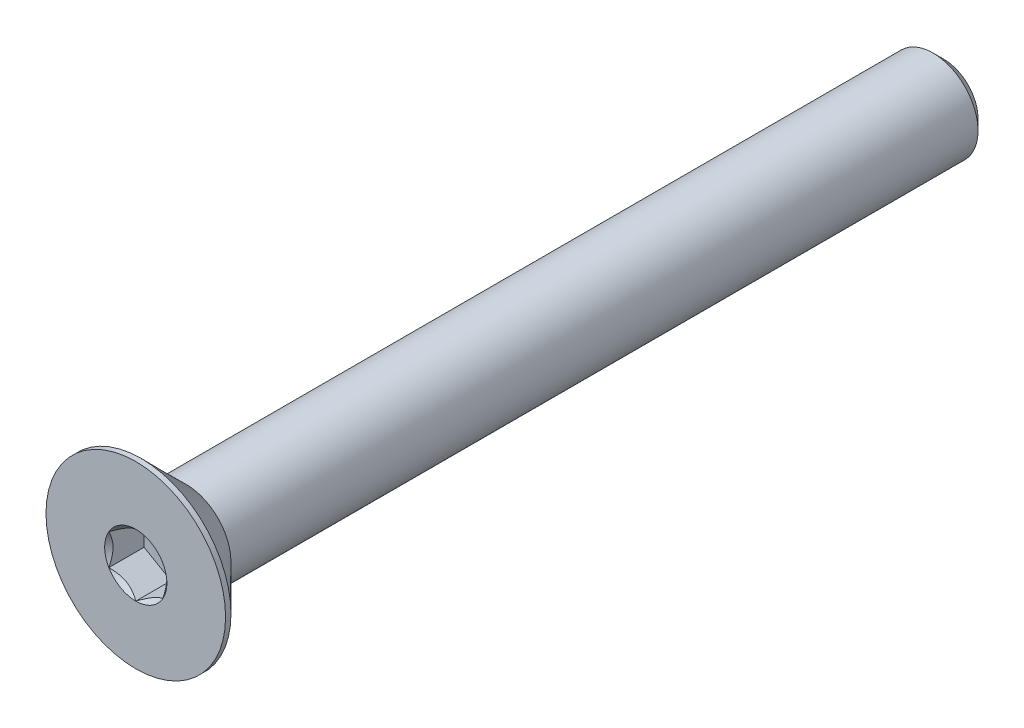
ISO-10303-21;
HEADER;
FILE_DESCRIPTION(('STEP AP214'),'2;1');
FILE_NAME('part.step','',(''),(''),'','','');
FILE_SCHEMA(('AUTOMOTIVE_DESIGN { 1 0 10303 214 1 1 1 1 }'));
ENDSEC;
DATA;
#1=APPLICATION_CONTEXT('core data for automotive mechanical design processes');
#2=APPLICATION_PROTOCOL_DEFINITION('international standard','automotive_design',2000,#1);
#3=PRODUCT_CONTEXT('',#1,'mechanical');
#4=PRODUCT('Part','Part','',(#3));
#5=PRODUCT_RELATED_PRODUCT_CATEGORY('part','',(#4));
#6=PRODUCT_DEFINITION_FORMATION('','',#4);
#7=PRODUCT_DEFINITION_CONTEXT('part definition',#1,'design');
#8=PRODUCT_DEFINITION('design','',#6,#7);
#9=PRODUCT_DEFINITION_SHAPE('','',#8);
#10=(LENGTH_UNIT() NAMED_UNIT(*) SI_UNIT(.MILLI.,.METRE.));
#11=(NAMED_UNIT(*) PLANE_ANGLE_UNIT() SI_UNIT($,.RADIAN.));
#12=(NAMED_UNIT(*) SI_UNIT($,.STERADIAN.) SOLID_ANGLE_UNIT());
#13=UNCERTAINTY_MEASURE_WITH_UNIT(LENGTH_MEASURE(1.E-05),#10,'distance_accuracy_value','');
#14=(GEOMETRIC_REPRESENTATION_CONTEXT(3) GLOBAL_UNCERTAINTY_ASSIGNED_CONTEXT((#13)) GLOBAL_UNIT_ASSIGNED_CONTEXT((#10,
#11,#12)) REPRESENTATION_CONTEXT('',''));
#15=CARTESIAN_POINT('',(0.,0.,0.));
#16=DIRECTION('',(0.,0.,1.));
#17=DIRECTION('',(1.,0.,0.));
#18=AXIS2_PLACEMENT_3D('',#15,#16,#17);
#19=CARTESIAN_POINT('',(0.,0.,-45.));
#20=DIRECTION('',(0.,0.,-1.));
#21=DIRECTION('',(0.,1.,0.));
#22=AXIS2_PLACEMENT_3D('',#19,#20,#21);
#23=CYLINDRICAL_SURFACE('',#22,2.5);
#24=CARTESIAN_POINT('',(0.,0.,-44.4));
#25=DIRECTION('',(0.,0.,-1.));
#26=DIRECTION('',(0.,1.,0.));
#27=AXIS2_PLACEMENT_3D('',#24,#25,#26);
#28=CIRCLE('',#27,2.5);
#29=CARTESIAN_POINT('',(0.,-2.5,-44.4));
#30=VERTEX_POINT('',#29);
#31=EDGE_CURVE('E51',#30,#30,#28,.F.);
#32=ORIENTED_EDGE('',*,*,#31,.T.);
#33=EDGE_LOOP('',(#32));
#34=FACE_BOUND('',#33,.T.);
#35=CARTESIAN_POINT('',(0.,0.,-2.8));
#36=DIRECTION('',(0.,0.,1.));
#37=DIRECTION('',(0.,-1.,0.));
#38=AXIS2_PLACEMENT_3D('',#35,#36,#37);
#39=CIRCLE('',#38,2.50000000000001);
#40=CARTESIAN_POINT('',(0.,-2.50000000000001,-2.79999999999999));
#41=VERTEX_POINT('',#40);
#42=EDGE_CURVE('E169',#41,#41,#39,.T.);
#43=ORIENTED_EDGE('',*,*,#42,.F.);
#44=EDGE_LOOP('',(#43));
#45=FACE_BOUND('',#44,.T.);
#46=ADVANCED_FACE('F37',(#34,#45),#23,.T.);
#47=CARTESIAN_POINT('',(0.,-2.5,-45.));
#48=DIRECTION('',(0.,0.,-1.));
#49=DIRECTION('',(0.,1.,0.));
#50=AXIS2_PLACEMENT_3D('',#47,#48,#49);
#51=PLANE('',#50);
#52=CARTESIAN_POINT('',(0.,0.,-45.));
#53=DIRECTION('',(0.,0.,-1.));
#54=DIRECTION('',(0.,1.,0.));
#55=AXIS2_PLACEMENT_3D('',#52,#53,#54);
#56=CIRCLE('',#55,1.89999999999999);
#57=CARTESIAN_POINT('',(0.,-1.89999999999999,-45.));
#58=VERTEX_POINT('',#57);
#59=EDGE_CURVE('E178',#58,#58,#56,.T.);
#60=ORIENTED_EDGE('',*,*,#59,.T.);
#61=EDGE_LOOP('',(#60));
#62=FACE_BOUND('',#61,.T.);
#63=ADVANCED_FACE('F188',(#62),#51,.T.);
#64=CARTESIAN_POINT('',(0.,0.,-45.));
#65=DIRECTION('',(0.,0.,1.));
#66=DIRECTION('',(0.,-1.,0.));
#67=AXIS2_PLACEMENT_3D('',#64,#65,#66);
#68=CONICAL_SURFACE('',#67,1.89999999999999,0.785398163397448);
#69=CARTESIAN_POINT('',(0.,-2.5,-44.4));
#70=CARTESIAN_POINT('',(0.,-2.49375,-44.40625));
#71=CARTESIAN_POINT('',(0.,-2.4875,-44.4125));
#72=CARTESIAN_POINT('',(0.,-2.475,-44.425));
#73=CARTESIAN_POINT('',(0.,-2.46875,-44.43125));
#74=CARTESIAN_POINT('',(0.,-2.45625,-44.44375));
#75=CARTESIAN_POINT('',(0.,-2.45,-44.45));
#76=CARTESIAN_POINT('',(0.,-2.4375,-44.4625));
#77=CARTESIAN_POINT('',(0.,-2.43125,-44.46875));
#78=CARTESIAN_POINT('',(0.,-2.41874999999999,-44.48125));
#79=CARTESIAN_POINT('',(0.,-2.41249999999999,-44.4875));
#80=CARTESIAN_POINT('',(0.,-2.4,-44.5));
#81=CARTESIAN_POINT('',(0.,-2.39375,-44.50625));
#82=CARTESIAN_POINT('',(0.,-2.38125,-44.51875));
#83=CARTESIAN_POINT('',(0.,-2.375,-44.525));
#84=CARTESIAN_POINT('',(0.,-2.36249999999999,-44.5375));
#85=CARTESIAN_POINT('',(0.,-2.35624999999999,-44.54375));
#86=CARTESIAN_POINT('',(0.,-2.34374999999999,-44.55625));
#87=CARTESIAN_POINT('',(0.,-2.33749999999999,-44.5625));
#88=CARTESIAN_POINT('',(0.,-2.32499999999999,-44.575));
#89=CARTESIAN_POINT('',(0.,-2.31874999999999,-44.58125));
#90=CARTESIAN_POINT('',(0.,-2.30624999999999,-44.59375));
#91=CARTESIAN_POINT('',(0.,-2.29999999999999,-44.6));
#92=CARTESIAN_POINT('',(0.,-2.28749999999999,-44.6125));
#93=CARTESIAN_POINT('',(0.,-2.28124999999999,-44.61875));
#94=CARTESIAN_POINT('',(0.,-2.26874999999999,-44.63125));
#95=CARTESIAN_POINT('',(0.,-2.26249999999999,-44.6375));
#96=CARTESIAN_POINT('',(0.,-2.24999999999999,-44.65));
#97=CARTESIAN_POINT('',(0.,-2.24374999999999,-44.65625));
#98=CARTESIAN_POINT('',(0.,-2.23124999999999,-44.66875));
#99=CARTESIAN_POINT('',(0.,-2.22499999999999,-44.675));
#100=CARTESIAN_POINT('',(0.,-2.21249999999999,-44.6875));
#101=CARTESIAN_POINT('',(0.,-2.20624999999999,-44.69375));
#102=CARTESIAN_POINT('',(0.,-2.19374999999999,-44.70625));
#103=CARTESIAN_POINT('',(0.,-2.18749999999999,-44.7125));
#104=CARTESIAN_POINT('',(0.,-2.17499999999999,-44.725));
#105=CARTESIAN_POINT('',(0.,-2.16874999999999,-44.73125));
#106=CARTESIAN_POINT('',(0.,-2.15624999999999,-44.74375));
#107=CARTESIAN_POINT('',(0.,-2.14999999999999,-44.75));
#108=CARTESIAN_POINT('',(0.,-2.13749999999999,-44.7625));
#109=CARTESIAN_POINT('',(0.,-2.13124999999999,-44.76875));
#110=CARTESIAN_POINT('',(0.,-2.11874999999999,-44.78125));
#111=CARTESIAN_POINT('',(0.,-2.11249999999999,-44.7875));
#112=CARTESIAN_POINT('',(0.,-2.09999999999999,-44.8));
#113=CARTESIAN_POINT('',(0.,-2.09374999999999,-44.80625));
#114=CARTESIAN_POINT('',(0.,-2.08124999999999,-44.81875));
#115=CARTESIAN_POINT('',(0.,-2.07499999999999,-44.825));
#116=CARTESIAN_POINT('',(0.,-2.06249999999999,-44.8375));
#117=CARTESIAN_POINT('',(0.,-2.05624999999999,-44.84375));
#118=CARTESIAN_POINT('',(0.,-2.04374999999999,-44.85625));
#119=CARTESIAN_POINT('',(0.,-2.03749999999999,-44.8625));
#120=CARTESIAN_POINT('',(0.,-2.02499999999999,-44.875));
#121=CARTESIAN_POINT('',(0.,-2.01874999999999,-44.88125));
#122=CARTESIAN_POINT('',(0.,-2.00624999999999,-44.89375));
#123=CARTESIAN_POINT('',(0.,-1.99999999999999,-44.9));
#124=CARTESIAN_POINT('',(0.,-1.98749999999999,-44.9125));
#125=CARTESIAN_POINT('',(0.,-1.98124999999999,-44.91875));
#126=CARTESIAN_POINT('',(0.,-1.96874999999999,-44.93125));
#127=CARTESIAN_POINT('',(0.,-1.96249999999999,-44.9375));
#128=CARTESIAN_POINT('',(0.,-1.94999999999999,-44.95));
#129=CARTESIAN_POINT('',(0.,-1.94374999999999,-44.95625));
#130=CARTESIAN_POINT('',(0.,-1.93124999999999,-44.96875));
#131=CARTESIAN_POINT('',(0.,-1.92499999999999,-44.975));
#132=CARTESIAN_POINT('',(0.,-1.91249999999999,-44.9875));
#133=CARTESIAN_POINT('',(0.,-1.90624999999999,-44.99375));
#134=CARTESIAN_POINT('',(0.,-1.89999999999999,-45.));
#135=B_SPLINE_CURVE_WITH_KNOTS('',3,(#69,#70,#71,#72,#73,#74,#75,#76,#77,#78,#79,#80,#81,#82,
#83,#84,#85,#86,#87,#88,#89,#90,#91,#92,#93,#94,#95,#96,#97,#98,#99,#100,#101,#102,#103,#104,
#105,#106,#107,#108,#109,#110,#111,#112,#113,#114,#115,#116,#117,#118,#119,#120,#121,#122,#123,
#124,#125,#126,#127,#128,#129,#130,#131,#132,#133,#134),.UNSPECIFIED.,.F.,.F.,(4,2,2,2,2,2,2,2,
2,2,2,2,2,2,2,2,2,2,2,2,2,2,2,2,2,2,2,2,2,2,2,2,4),(0.,0.026516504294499,0.0530330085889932,
0.0795495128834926,0.106066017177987,0.132582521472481,0.15909902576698,0.185615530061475,
0.212132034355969,0.238648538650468,0.265165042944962,0.291681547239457,0.318198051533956,
0.34471455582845,0.371231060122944,0.397747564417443,0.424264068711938,0.450780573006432,
0.477297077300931,0.503813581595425,0.53033008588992,0.556846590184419,0.583363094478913,
0.609879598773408,0.636396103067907,0.662912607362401,0.689429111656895,0.715945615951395,
0.742462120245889,0.768978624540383,0.795495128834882,0.822011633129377,0.848528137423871),.UNSPECIFIED.);
#136=EDGE_CURVE('BSEAM39',#30,#58,#135,.T.);
#137=ORIENTED_EDGE('',*,*,#31,.F.);
#138=ORIENTED_EDGE('',*,*,#59,.F.);
#139=ORIENTED_EDGE('',*,*,#136,.T.);
#140=ORIENTED_EDGE('',*,*,#136,.F.);
#141=EDGE_LOOP('',(#137,#139,#138,#140));
#142=FACE_BOUND('',#141,.T.);
#143=ADVANCED_FACE('F39',(#142),#68,.T.);
#144=CARTESIAN_POINT('',(0.,0.,0.));
#145=DIRECTION('',(0.,0.,1.));
#146=DIRECTION('',(0.,-1.,0.));
#147=AXIS2_PLACEMENT_3D('',#144,#145,#146);
#148=CYLINDRICAL_SURFACE('',#147,5.);
#149=CARTESIAN_POINT('',(0.,0.,0.));
#150=DIRECTION('',(0.,0.,1.));
#151=DIRECTION('',(0.,-1.,0.));
#152=AXIS2_PLACEMENT_3D('',#149,#150,#151);
#153=CIRCLE('',#152,5.);
#154=CARTESIAN_POINT('',(0.,-5.,0.));
#155=VERTEX_POINT('',#154);
#156=EDGE_CURVE('E175',#155,#155,#153,.T.);
#157=ORIENTED_EDGE('',*,*,#156,.F.);
#158=EDGE_LOOP('',(#157));
#159=FACE_BOUND('',#158,.T.);
#160=CARTESIAN_POINT('',(0.,0.,-0.300000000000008));
#161=DIRECTION('',(0.,0.,1.));
#162=DIRECTION('',(0.,-1.,0.));
#163=AXIS2_PLACEMENT_3D('',#160,#161,#162);
#164=CIRCLE('',#163,5.);
#165=CARTESIAN_POINT('',(0.,-5.,-0.300000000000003));
#166=VERTEX_POINT('',#165);
#167=EDGE_CURVE('E172',#166,#166,#164,.T.);
#168=ORIENTED_EDGE('',*,*,#167,.T.);
#169=EDGE_LOOP('',(#168));
#170=FACE_BOUND('',#169,.T.);
#171=ADVANCED_FACE('F187',(#159,#170),#148,.T.);
#172=CARTESIAN_POINT('',(0.,0.,-2.8));
#173=DIRECTION('',(0.,0.,1.));
#174=DIRECTION('',(0.,-1.,0.));
#175=AXIS2_PLACEMENT_3D('',#172,#173,#174);
#176=CONICAL_SURFACE('',#175,2.50000000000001,0.78539816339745);
#177=ORIENTED_EDGE('',*,*,#167,.F.);
#178=EDGE_LOOP('',(#177));
#179=FACE_BOUND('',#178,.T.);
#180=ORIENTED_EDGE('',*,*,#42,.T.);
#181=EDGE_LOOP('',(#180));
#182=FACE_BOUND('',#181,.T.);
#183=ADVANCED_FACE('F199',(#179,#182),#176,.T.);
#184=CARTESIAN_POINT('',(0.,-2.5,0.));
#185=DIRECTION('',(0.,0.,1.));
#186=DIRECTION('',(0.,-1.,0.));
#187=AXIS2_PLACEMENT_3D('',#184,#185,#186);
#188=PLANE('',#187);
#189=CARTESIAN_POINT('',(0.,0.,0.));
#190=DIRECTION('',(0.,0.,1.));
#191=DIRECTION('',(1.,0.,0.));
#192=AXIS2_PLACEMENT_3D('',#189,#190,#191);
#193=CIRCLE('',#192,1.73205080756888);
#194=CARTESIAN_POINT('',(0.,-1.73205080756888,0.));
#195=VERTEX_POINT('',#194);
#196=CARTESIAN_POINT('',(1.5,-0.86602540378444,0.));
#197=VERTEX_POINT('',#196);
#198=EDGE_CURVE('E97',#195,#197,#193,.T.);
#199=ORIENTED_EDGE('',*,*,#198,.F.);
#200=CARTESIAN_POINT('',(-1.5,-0.866025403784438,0.));
#201=VERTEX_POINT('',#200);
#202=EDGE_CURVE('E57',#201,#195,#193,.T.);
#203=ORIENTED_EDGE('',*,*,#202,.F.);
#204=CARTESIAN_POINT('',(-1.5,0.86602540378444,0.));
#205=VERTEX_POINT('',#204);
#206=EDGE_CURVE('E139',#205,#201,#193,.T.);
#207=ORIENTED_EDGE('',*,*,#206,.F.);
#208=CARTESIAN_POINT('',(0.,1.73205080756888,0.));
#209=VERTEX_POINT('',#208);
#210=EDGE_CURVE('E64',#209,#205,#193,.T.);
#211=ORIENTED_EDGE('',*,*,#210,.F.);
#212=CARTESIAN_POINT('',(1.5,0.866025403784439,0.));
#213=VERTEX_POINT('',#212);
#214=EDGE_CURVE('E133',#213,#209,#193,.T.);
#215=ORIENTED_EDGE('',*,*,#214,.F.);
#216=EDGE_CURVE('E105',#197,#213,#193,.T.);
#217=ORIENTED_EDGE('',*,*,#216,.F.);
#218=EDGE_LOOP('',(#199,#203,#207,#211,#215,#217));
#219=FACE_BOUND('',#218,.T.);
#220=ORIENTED_EDGE('',*,*,#156,.T.);
#221=EDGE_LOOP('',(#220));
#222=FACE_BOUND('',#221,.T.);
#223=ADVANCED_FACE('F131',(#219,#222),#188,.T.);
#224=CARTESIAN_POINT('',(0.,0.,0.));
#225=DIRECTION('',(0.,0.,1.));
#226=DIRECTION('',(1.,0.,0.));
#227=AXIS2_PLACEMENT_3D('',#224,#225,#226);
#228=CONICAL_SURFACE('',#227,1.73205080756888,0.78539816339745);
#229=ORIENTED_EDGE('',*,*,#216,.T.);
#230=CARTESIAN_POINT('',(1.5,-1.72720812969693,0.555578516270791));
#231=CARTESIAN_POINT('',(1.5,-1.68515175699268,0.523829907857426));
#232=CARTESIAN_POINT('',(1.5,-1.64286104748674,0.492392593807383));
#233=CARTESIAN_POINT('',(1.5,-1.55771581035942,0.430269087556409));
#234=CARTESIAN_POINT('',(1.5,-1.51486114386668,0.399583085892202));
#235=CARTESIAN_POINT('',(1.5,-1.3846813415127,0.308407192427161));
#236=CARTESIAN_POINT('',(1.5,-1.29637976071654,0.249288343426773));
#237=CARTESIAN_POINT('',(1.5,-1.11121478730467,0.133230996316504));
#238=CARTESIAN_POINT('',(1.5,-1.01415038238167,0.0766095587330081));
#239=CARTESIAN_POINT('',(1.5,-0.815173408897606,-0.0269631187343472));
#240=CARTESIAN_POINT('',(1.5,-0.713278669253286,-0.0739469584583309));
#241=CARTESIAN_POINT('',(1.5,-0.560333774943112,-0.131427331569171));
#242=CARTESIAN_POINT('',(1.5,-0.511547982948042,-0.147924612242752));
#243=CARTESIAN_POINT('',(1.5,-0.412798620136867,-0.177002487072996));
#244=CARTESIAN_POINT('',(1.5,-0.362834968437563,-0.189582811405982));
#245=CARTESIAN_POINT('',(1.5,-0.262863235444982,-0.209963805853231));
#246=CARTESIAN_POINT('',(1.5,-0.212872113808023,-0.21784636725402));
#247=CARTESIAN_POINT('',(1.5,-0.112355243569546,-0.228677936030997));
#248=CARTESIAN_POINT('',(1.5,-0.0618295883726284,-0.23162779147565));
#249=CARTESIAN_POINT('',(1.5,0.0374291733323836,-0.232375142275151));
#250=CARTESIAN_POINT('',(1.5,0.0861609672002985,-0.230355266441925));
#251=CARTESIAN_POINT('',(1.5,0.183206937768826,-0.221677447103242));
#252=CARTESIAN_POINT('',(1.5,0.231521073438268,-0.215019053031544));
#253=CARTESIAN_POINT('',(1.5,0.328199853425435,-0.197314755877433));
#254=CARTESIAN_POINT('',(1.5,0.376550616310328,-0.186194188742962));
#255=CARTESIAN_POINT('',(1.5,0.472195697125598,-0.160156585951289));
#256=CARTESIAN_POINT('',(1.5,0.51949010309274,-0.145239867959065));
#257=CARTESIAN_POINT('',(1.5,0.668391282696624,-0.0926647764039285));
#258=CARTESIAN_POINT('',(1.5,0.767878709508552,-0.0490187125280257));
#259=CARTESIAN_POINT('',(1.5,0.962179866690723,0.048022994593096));
#260=CARTESIAN_POINT('',(1.5,1.05697519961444,0.101453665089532));
#261=CARTESIAN_POINT('',(1.5,1.23814273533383,0.211685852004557));
#262=CARTESIAN_POINT('',(1.5,1.32469942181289,0.268187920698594));
#263=CARTESIAN_POINT('',(1.5,1.45222331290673,0.355534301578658));
#264=CARTESIAN_POINT('',(1.5,1.49418091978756,0.384957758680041));
#265=CARTESIAN_POINT('',(1.5,1.57752272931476,0.444582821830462));
#266=CARTESIAN_POINT('',(1.5,1.61890708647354,0.474784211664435));
#267=CARTESIAN_POINT('',(1.5,1.66005278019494,0.505308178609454));
#268=B_SPLINE_CURVE_WITH_KNOTS('',3,(#230,#231,#232,#233,#234,#235,#236,#237,#238,#239,#240,
#241,#242,#243,#244,#245,#246,#247,#248,#249,#250,#251,#252,#253,#254,#255,#256,#257,#258,#259,
#260,#261,#262,#263,#264,#265,#266,#267),.UNSPECIFIED.,.F.,.F.,(4,2,2,2,2,2,2,2,2,2,2,2,2,2,2,2,
2,2,4),(0.,0.158079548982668,0.316198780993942,0.634850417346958,0.97169031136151,
1.30737131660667,1.46173961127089,1.61611853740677,1.7677210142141,1.91929742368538,
2.065387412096,2.21149159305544,2.36014984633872,2.50879566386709,2.83376031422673,
3.15991186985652,3.46985601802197,3.62358896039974,3.7772796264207),.UNSPECIFIED.);
#269=EDGE_CURVE('E11',#197,#213,#268,.T.);
#270=ORIENTED_EDGE('',*,*,#269,.F.);
#271=EDGE_LOOP('',(#229,#270));
#272=FACE_BOUND('',#271,.T.);
#273=ADVANCED_FACE('F109',(#272),#228,.F.);
#274=ORIENTED_EDGE('',*,*,#214,.T.);
#275=CARTESIAN_POINT('',(1.5002,0.865909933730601,0.000115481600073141));
#276=CARTESIAN_POINT('',(1.44863220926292,0.895682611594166,-0.0296345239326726));
#277=CARTESIAN_POINT('',(1.3962020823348,0.925953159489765,-0.0576375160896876));
#278=CARTESIAN_POINT('',(1.2892909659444,0.987678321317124,-0.108910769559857));
#279=CARTESIAN_POINT('',(1.23479980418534,1.01913880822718,-0.132152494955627));
#280=CARTESIAN_POINT('',(1.12492091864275,1.08257741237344,-0.17196627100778));
#281=CARTESIAN_POINT('',(1.0695611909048,1.11453936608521,-0.188638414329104));
#282=CARTESIAN_POINT('',(0.957622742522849,1.1791670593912,-0.214325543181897));
#283=CARTESIAN_POINT('',(0.901047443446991,1.21183082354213,-0.223359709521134));
#284=CARTESIAN_POINT('',(0.803544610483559,1.26812411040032,-0.231510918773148));
#285=CARTESIAN_POINT('',(0.762743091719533,1.29168087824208,-0.232717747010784));
#286=CARTESIAN_POINT('',(0.681212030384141,1.33875285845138,-0.230685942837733));
#287=CARTESIAN_POINT('',(0.640482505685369,1.36226806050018,-0.227446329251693));
#288=CARTESIAN_POINT('',(0.559415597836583,1.40907206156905,-0.216708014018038));
#289=CARTESIAN_POINT('',(0.519078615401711,1.43236062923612,-0.209205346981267));
#290=CARTESIAN_POINT('',(0.439081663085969,1.47854689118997,-0.19034838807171));
#291=CARTESIAN_POINT('',(0.399421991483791,1.50144441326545,-0.178992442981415));
#292=CARTESIAN_POINT('',(0.297836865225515,1.56009461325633,-0.145278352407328));
#293=CARTESIAN_POINT('',(0.236541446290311,1.59548353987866,-0.120378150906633));
#294=CARTESIAN_POINT('',(0.146414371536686,1.64751843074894,-0.0783433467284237));
#295=CARTESIAN_POINT('',(0.116714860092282,1.66466545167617,-0.0635748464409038));
#296=CARTESIAN_POINT('',(0.0578620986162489,1.69864410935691,-0.0326894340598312));
#297=CARTESIAN_POINT('',(0.0287085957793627,1.71547589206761,-0.0165731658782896));
#298=CARTESIAN_POINT('',(-0.00020000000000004,1.73216627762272,0.000115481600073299));
#299=B_SPLINE_CURVE_WITH_KNOTS('',3,(#275,#276,#277,#278,#279,#280,#281,#282,#283,#284,#285,
#286,#287,#288,#289,#290,#291,#292,#293,#294,#295,#296,#297,#298),.UNSPECIFIED.,.F.,.F.,(4,2,2,
2,2,2,2,2,2,2,2,4),(0.,0.199829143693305,0.400822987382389,0.598623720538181,0.79592624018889,
0.937113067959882,1.07833105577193,1.21968061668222,1.36109089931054,1.58570969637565,
1.69770705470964,1.80965120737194),.UNSPECIFIED.);
#300=EDGE_CURVE('E135',#213,#209,#299,.T.);
#301=ORIENTED_EDGE('',*,*,#300,.F.);
#302=EDGE_LOOP('',(#274,#301));
#303=FACE_BOUND('',#302,.T.);
#304=ADVANCED_FACE('F279',(#303),#228,.F.);
#305=ORIENTED_EDGE('',*,*,#210,.T.);
#306=CARTESIAN_POINT('',(0.000199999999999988,1.73216627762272,0.000115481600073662));
#307=CARTESIAN_POINT('',(-0.0513677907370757,1.70239359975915,-0.029634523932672));
#308=CARTESIAN_POINT('',(-0.103797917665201,1.67212305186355,-0.0576375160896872));
#309=CARTESIAN_POINT('',(-0.210709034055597,1.61039789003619,-0.108910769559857));
#310=CARTESIAN_POINT('',(-0.265200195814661,1.57893740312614,-0.132152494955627));
#311=CARTESIAN_POINT('',(-0.375079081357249,1.51549879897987,-0.17196627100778));
#312=CARTESIAN_POINT('',(-0.4304388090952,1.4835368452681,-0.188638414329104));
#313=CARTESIAN_POINT('',(-0.542377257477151,1.41890915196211,-0.214325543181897));
#314=CARTESIAN_POINT('',(-0.598952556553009,1.38624538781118,-0.223359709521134));
#315=CARTESIAN_POINT('',(-0.696455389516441,1.329952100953,-0.231510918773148));
#316=CARTESIAN_POINT('',(-0.737256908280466,1.30639533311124,-0.232717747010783));
#317=CARTESIAN_POINT('',(-0.818787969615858,1.25932335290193,-0.230685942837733));
#318=CARTESIAN_POINT('',(-0.85951749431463,1.23580815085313,-0.227446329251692));
#319=CARTESIAN_POINT('',(-0.940584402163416,1.18900414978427,-0.216708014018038));
#320=CARTESIAN_POINT('',(-0.980921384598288,1.1657155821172,-0.209205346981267));
#321=CARTESIAN_POINT('',(-1.06091833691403,1.11952932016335,-0.19034838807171));
#322=CARTESIAN_POINT('',(-1.10057800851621,1.09663179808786,-0.178992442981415));
#323=CARTESIAN_POINT('',(-1.20216313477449,1.03798159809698,-0.145278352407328));
#324=CARTESIAN_POINT('',(-1.26345855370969,1.00259267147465,-0.120378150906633));
#325=CARTESIAN_POINT('',(-1.35358562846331,0.950557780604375,-0.078343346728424));
#326=CARTESIAN_POINT('',(-1.38328513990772,0.933410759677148,-0.0635748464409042));
#327=CARTESIAN_POINT('',(-1.44213790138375,0.899432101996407,-0.0326894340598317));
#328=CARTESIAN_POINT('',(-1.47129140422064,0.882600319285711,-0.01657316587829));
#329=CARTESIAN_POINT('',(-1.5002,0.865909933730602,0.000115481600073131));
#330=B_SPLINE_CURVE_WITH_KNOTS('',3,(#306,#307,#308,#309,#310,#311,#312,#313,#314,#315,#316,
#317,#318,#319,#320,#321,#322,#323,#324,#325,#326,#327,#328,#329),.UNSPECIFIED.,.F.,.F.,(4,2,2,
2,2,2,2,2,2,2,2,4),(0.,0.199829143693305,0.400822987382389,0.598623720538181,0.795926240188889,
0.937113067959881,1.07833105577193,1.21968061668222,1.36109089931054,1.58570969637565,
1.69770705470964,1.80965120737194),.UNSPECIFIED.);
#331=EDGE_CURVE('E138',#209,#205,#330,.T.);
#332=ORIENTED_EDGE('',*,*,#331,.F.);
#333=EDGE_LOOP('',(#305,#332));
#334=FACE_BOUND('',#333,.T.);
#335=ADVANCED_FACE('F275',(#334),#228,.F.);
#336=ORIENTED_EDGE('',*,*,#206,.T.);
#337=CARTESIAN_POINT('',(-1.5,-1.72720812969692,0.555578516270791));
#338=CARTESIAN_POINT('',(-1.5,-1.68515175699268,0.523829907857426));
#339=CARTESIAN_POINT('',(-1.5,-1.64286104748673,0.492392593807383));
#340=CARTESIAN_POINT('',(-1.5,-1.55771581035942,0.430269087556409));
#341=CARTESIAN_POINT('',(-1.5,-1.51486114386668,0.399583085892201));
#342=CARTESIAN_POINT('',(-1.5,-1.3846813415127,0.30840719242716));
#343=CARTESIAN_POINT('',(-1.5,-1.29637976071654,0.249288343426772));
#344=CARTESIAN_POINT('',(-1.5,-1.11121478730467,0.133230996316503));
#345=CARTESIAN_POINT('',(-1.5,-1.01415038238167,0.0766095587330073));
#346=CARTESIAN_POINT('',(-1.5,-0.815173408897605,-0.0269631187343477));
#347=CARTESIAN_POINT('',(-1.5,-0.713278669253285,-0.073946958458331));
#348=CARTESIAN_POINT('',(-1.5,-0.560333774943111,-0.131427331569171));
#349=CARTESIAN_POINT('',(-1.5,-0.511547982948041,-0.147924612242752));
#350=CARTESIAN_POINT('',(-1.5,-0.412798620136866,-0.177002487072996));
#351=CARTESIAN_POINT('',(-1.5,-0.362834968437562,-0.189582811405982));
#352=CARTESIAN_POINT('',(-1.5,-0.262863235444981,-0.209963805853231));
#353=CARTESIAN_POINT('',(-1.5,-0.212872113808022,-0.21784636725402));
#354=CARTESIAN_POINT('',(-1.5,-0.112355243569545,-0.228677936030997));
#355=CARTESIAN_POINT('',(-1.5,-0.0618295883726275,-0.23162779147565));
#356=CARTESIAN_POINT('',(-1.5,0.0374291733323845,-0.232375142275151));
#357=CARTESIAN_POINT('',(-1.5,0.0861609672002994,-0.230355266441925));
#358=CARTESIAN_POINT('',(-1.5,0.183206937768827,-0.221677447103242));
#359=CARTESIAN_POINT('',(-1.5,0.231521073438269,-0.215019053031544));
#360=CARTESIAN_POINT('',(-1.5,0.328199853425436,-0.197314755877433));
#361=CARTESIAN_POINT('',(-1.5,0.376550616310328,-0.186194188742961));
#362=CARTESIAN_POINT('',(-1.5,0.472195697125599,-0.160156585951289));
#363=CARTESIAN_POINT('',(-1.5,0.519490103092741,-0.145239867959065));
#364=CARTESIAN_POINT('',(-1.5,0.668391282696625,-0.0926647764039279));
#365=CARTESIAN_POINT('',(-1.5,0.767878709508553,-0.0490187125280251));
#366=CARTESIAN_POINT('',(-1.5,0.962179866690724,0.0480229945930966));
#367=CARTESIAN_POINT('',(-1.5,1.05697519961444,0.101453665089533));
#368=CARTESIAN_POINT('',(-1.5,1.23814273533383,0.211685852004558));
#369=CARTESIAN_POINT('',(-1.5,1.3246994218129,0.268187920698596));
#370=CARTESIAN_POINT('',(-1.5,1.45222331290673,0.355534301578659));
#371=CARTESIAN_POINT('',(-1.5,1.49418091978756,0.384957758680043));
#372=CARTESIAN_POINT('',(-1.5,1.57752272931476,0.444582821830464));
#373=CARTESIAN_POINT('',(-1.5,1.61890708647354,0.474784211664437));
#374=CARTESIAN_POINT('',(-1.5,1.66005278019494,0.505308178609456));
#375=B_SPLINE_CURVE_WITH_KNOTS('',3,(#337,#338,#339,#340,#341,#342,#343,#344,#345,#346,#347,
#348,#349,#350,#351,#352,#353,#354,#355,#356,#357,#358,#359,#360,#361,#362,#363,#364,#365,#366,
#367,#368,#369,#370,#371,#372,#373,#374),.UNSPECIFIED.,.F.,.F.,(4,2,2,2,2,2,2,2,2,2,2,2,2,2,2,2,
2,2,4),(0.,0.158079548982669,0.316198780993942,0.634850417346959,0.97169031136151,
1.30737131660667,1.46173961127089,1.61611853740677,1.7677210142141,1.91929742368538,
2.065387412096,2.21149159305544,2.36014984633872,2.50879566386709,2.83376031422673,
3.15991186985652,3.46985601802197,3.62358896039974,3.77727962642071),.UNSPECIFIED.);
#376=EDGE_CURVE('E145',#205,#201,#375,.F.);
#377=ORIENTED_EDGE('',*,*,#376,.F.);
#378=EDGE_LOOP('',(#336,#377));
#379=FACE_BOUND('',#378,.T.);
#380=ADVANCED_FACE('F143',(#379),#228,.F.);
#381=ORIENTED_EDGE('',*,*,#202,.T.);
#382=CARTESIAN_POINT('',(-1.5002,-0.8659099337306,0.000115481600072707));
#383=CARTESIAN_POINT('',(-1.44863220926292,-0.895682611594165,-0.0296345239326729));
#384=CARTESIAN_POINT('',(-1.3962020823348,-0.925953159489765,-0.0576375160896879));
#385=CARTESIAN_POINT('',(-1.2892909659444,-0.987678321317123,-0.108910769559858));
#386=CARTESIAN_POINT('',(-1.23479980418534,-1.01913880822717,-0.132152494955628));
#387=CARTESIAN_POINT('',(-1.12492091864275,-1.08257741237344,-0.171966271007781));
#388=CARTESIAN_POINT('',(-1.0695611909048,-1.11453936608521,-0.188638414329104));
#389=CARTESIAN_POINT('',(-0.95762274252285,-1.1791670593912,-0.214325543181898));
#390=CARTESIAN_POINT('',(-0.901047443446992,-1.21183082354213,-0.223359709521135));
#391=CARTESIAN_POINT('',(-0.803544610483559,-1.26812411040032,-0.231510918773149));
#392=CARTESIAN_POINT('',(-0.762743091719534,-1.29168087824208,-0.232717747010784));
#393=CARTESIAN_POINT('',(-0.681212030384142,-1.33875285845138,-0.230685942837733));
#394=CARTESIAN_POINT('',(-0.64048250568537,-1.36226806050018,-0.227446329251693));
#395=CARTESIAN_POINT('',(-0.559415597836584,-1.40907206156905,-0.216708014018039));
#396=CARTESIAN_POINT('',(-0.519078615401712,-1.43236062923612,-0.209205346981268));
#397=CARTESIAN_POINT('',(-0.439081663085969,-1.47854689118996,-0.19034838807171));
#398=CARTESIAN_POINT('',(-0.399421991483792,-1.50144441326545,-0.178992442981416));
#399=CARTESIAN_POINT('',(-0.297836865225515,-1.56009461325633,-0.145278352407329));
#400=CARTESIAN_POINT('',(-0.236541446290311,-1.59548353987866,-0.120378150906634));
#401=CARTESIAN_POINT('',(-0.146414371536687,-1.64751843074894,-0.0783433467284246));
#402=CARTESIAN_POINT('',(-0.116714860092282,-1.66466545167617,-0.0635748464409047));
#403=CARTESIAN_POINT('',(-0.0578620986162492,-1.69864410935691,-0.032689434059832));
#404=CARTESIAN_POINT('',(-0.0287085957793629,-1.71547589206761,-0.0165731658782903));
#405=CARTESIAN_POINT('',(0.000199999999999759,-1.73216627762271,0.000115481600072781));
#406=B_SPLINE_CURVE_WITH_KNOTS('',3,(#382,#383,#384,#385,#386,#387,#388,#389,#390,#391,#392,
#393,#394,#395,#396,#397,#398,#399,#400,#401,#402,#403,#404,#405),.UNSPECIFIED.,.F.,.F.,(4,2,2,
2,2,2,2,2,2,2,2,4),(0.,0.199829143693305,0.400822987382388,0.59862372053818,0.795926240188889,
0.937113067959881,1.07833105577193,1.21968061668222,1.36109089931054,1.58570969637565,
1.69770705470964,1.80965120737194),.UNSPECIFIED.);
#407=EDGE_CURVE('E121',#201,#195,#406,.T.);
#408=ORIENTED_EDGE('',*,*,#407,.F.);
#409=EDGE_LOOP('',(#381,#408));
#410=FACE_BOUND('',#409,.T.);
#411=ADVANCED_FACE('F227',(#410),#228,.F.);
#412=ORIENTED_EDGE('',*,*,#198,.T.);
#413=CARTESIAN_POINT('',(-0.000200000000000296,-1.73216627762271,0.000115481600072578));
#414=CARTESIAN_POINT('',(0.0513677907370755,-1.70239359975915,-0.0296345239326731));
#415=CARTESIAN_POINT('',(0.103797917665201,-1.67212305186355,-0.0576375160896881));
#416=CARTESIAN_POINT('',(0.210709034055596,-1.61039789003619,-0.108910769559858));
#417=CARTESIAN_POINT('',(0.265200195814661,-1.57893740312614,-0.132152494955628));
#418=CARTESIAN_POINT('',(0.375079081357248,-1.51549879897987,-0.171966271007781));
#419=CARTESIAN_POINT('',(0.430438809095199,-1.4835368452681,-0.188638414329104));
#420=CARTESIAN_POINT('',(0.54237725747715,-1.41890915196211,-0.214325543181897));
#421=CARTESIAN_POINT('',(0.598952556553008,-1.38624538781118,-0.223359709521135));
#422=CARTESIAN_POINT('',(0.69645538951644,-1.32995210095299,-0.231510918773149));
#423=CARTESIAN_POINT('',(0.737256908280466,-1.30639533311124,-0.232717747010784));
#424=CARTESIAN_POINT('',(0.818787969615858,-1.25932335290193,-0.230685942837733));
#425=CARTESIAN_POINT('',(0.859517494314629,-1.23580815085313,-0.227446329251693));
#426=CARTESIAN_POINT('',(0.940584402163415,-1.18900414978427,-0.216708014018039));
#427=CARTESIAN_POINT('',(0.980921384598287,-1.1657155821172,-0.209205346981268));
#428=CARTESIAN_POINT('',(1.06091833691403,-1.11952932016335,-0.19034838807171));
#429=CARTESIAN_POINT('',(1.10057800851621,-1.09663179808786,-0.178992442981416));
#430=CARTESIAN_POINT('',(1.20216313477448,-1.03798159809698,-0.145278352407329));
#431=CARTESIAN_POINT('',(1.26345855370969,-1.00259267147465,-0.120378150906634));
#432=CARTESIAN_POINT('',(1.35358562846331,-0.950557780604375,-0.0783433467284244));
#433=CARTESIAN_POINT('',(1.38328513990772,-0.933410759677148,-0.0635748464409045));
#434=CARTESIAN_POINT('',(1.44213790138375,-0.899432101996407,-0.0326894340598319));
#435=CARTESIAN_POINT('',(1.47129140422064,-0.88260031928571,-0.0165731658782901));
#436=CARTESIAN_POINT('',(1.5002,-0.865909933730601,0.000115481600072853));
#437=B_SPLINE_CURVE_WITH_KNOTS('',3,(#413,#414,#415,#416,#417,#418,#419,#420,#421,#422,#423,
#424,#425,#426,#427,#428,#429,#430,#431,#432,#433,#434,#435,#436),.UNSPECIFIED.,.F.,.F.,(4,2,2,
2,2,2,2,2,2,2,2,4),(0.,0.199829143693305,0.400822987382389,0.59862372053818,0.795926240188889,
0.937113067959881,1.07833105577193,1.21968061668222,1.36109089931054,1.58570969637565,
1.69770705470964,1.80965120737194),.UNSPECIFIED.);
#438=EDGE_CURVE('E101',#195,#197,#437,.T.);
#439=ORIENTED_EDGE('',*,*,#438,.F.);
#440=EDGE_LOOP('',(#412,#439));
#441=FACE_BOUND('',#440,.T.);
#442=ADVANCED_FACE('F99',(#441),#228,.F.);
#443=CARTESIAN_POINT('',(1.5,-0.866025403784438,-1.96));
#444=DIRECTION('',(0.,0.,1.));
#445=DIRECTION('',(1.,0.,0.));
#446=AXIS2_PLACEMENT_3D('',#443,#444,#445);
#447=PLANE('',#446);
#448=DIRECTION('',(0.866025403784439,0.5,0.));
#449=VECTOR('',#448,1.);
#450=CARTESIAN_POINT('',(0.,-1.73205080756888,-1.96));
#451=LINE('',#450,#449);
#452=CARTESIAN_POINT('',(0.,-1.73205080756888,-1.96));
#453=VERTEX_POINT('',#452);
#454=CARTESIAN_POINT('',(1.5,-0.866025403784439,-1.96));
#455=VERTEX_POINT('',#454);
#456=EDGE_CURVE('E120',#453,#455,#451,.T.);
#457=ORIENTED_EDGE('',*,*,#456,.T.);
#458=DIRECTION('',(0.,1.,0.));
#459=VECTOR('',#458,1.);
#460=CARTESIAN_POINT('',(1.5,-0.866025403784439,-1.96));
#461=LINE('',#460,#459);
#462=CARTESIAN_POINT('',(1.5,0.866025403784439,-1.96));
#463=VERTEX_POINT('',#462);
#464=EDGE_CURVE('E125',#455,#463,#461,.T.);
#465=ORIENTED_EDGE('',*,*,#464,.T.);
#466=DIRECTION('',(-0.866025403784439,0.5,0.));
#467=VECTOR('',#466,1.);
#468=CARTESIAN_POINT('',(1.5,0.866025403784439,-1.96));
#469=LINE('',#468,#467);
#470=CARTESIAN_POINT('',(0.,1.73205080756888,-1.96));
#471=VERTEX_POINT('',#470);
#472=EDGE_CURVE('E261',#463,#471,#469,.T.);
#473=ORIENTED_EDGE('',*,*,#472,.T.);
#474=DIRECTION('',(-0.866025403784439,-0.5,0.));
#475=VECTOR('',#474,1.);
#476=CARTESIAN_POINT('',(0.,1.73205080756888,-1.96));
#477=LINE('',#476,#475);
#478=CARTESIAN_POINT('',(-1.5,0.866025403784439,-1.96));
#479=VERTEX_POINT('',#478);
#480=EDGE_CURVE('E263',#471,#479,#477,.T.);
#481=ORIENTED_EDGE('',*,*,#480,.T.);
#482=DIRECTION('',(0.,-1.,0.));
#483=VECTOR('',#482,1.);
#484=CARTESIAN_POINT('',(-1.5,0.866025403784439,-1.96));
#485=LINE('',#484,#483);
#486=CARTESIAN_POINT('',(-1.5,-0.866025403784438,-1.96));
#487=VERTEX_POINT('',#486);
#488=EDGE_CURVE('E160',#479,#487,#485,.T.);
#489=ORIENTED_EDGE('',*,*,#488,.T.);
#490=DIRECTION('',(0.866025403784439,-0.5,0.));
#491=VECTOR('',#490,1.);
#492=CARTESIAN_POINT('',(-1.5,-0.866025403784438,-1.96));
#493=LINE('',#492,#491);
#494=EDGE_CURVE('E128',#487,#453,#493,.T.);
#495=ORIENTED_EDGE('',*,*,#494,.T.);
#496=EDGE_LOOP('',(#457,#465,#473,#481,#489,#495));
#497=FACE_BOUND('',#496,.T.);
#498=ADVANCED_FACE('F226',(#497),#447,.T.);
#499=CARTESIAN_POINT('',(1.5,-0.866025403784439,-1.96));
#500=DIRECTION('',(1.,0.,0.));
#501=DIRECTION('',(0.,1.,0.));
#502=AXIS2_PLACEMENT_3D('',#499,#500,#501);
#503=PLANE('',#502);
#504=DIRECTION('',(0.,0.,1.));
#505=VECTOR('',#504,1.);
#506=CARTESIAN_POINT('',(1.5,-0.866025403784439,-1.96));
#507=LINE('',#506,#505);
#508=EDGE_CURVE('E117',#455,#197,#507,.T.);
#509=ORIENTED_EDGE('',*,*,#508,.T.);
#510=ORIENTED_EDGE('',*,*,#269,.T.);
#511=DIRECTION('',(0.,0.,1.));
#512=VECTOR('',#511,1.);
#513=CARTESIAN_POINT('',(1.5,0.866025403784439,-1.96));
#514=LINE('',#513,#512);
#515=EDGE_CURVE('E127',#463,#213,#514,.T.);
#516=ORIENTED_EDGE('',*,*,#515,.F.);
#517=ORIENTED_EDGE('',*,*,#464,.F.);
#518=EDGE_LOOP('',(#509,#510,#516,#517));
#519=FACE_BOUND('',#518,.T.);
#520=ADVANCED_FACE('F123',(#519),#503,.F.);
#521=CARTESIAN_POINT('',(1.5,0.866025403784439,-1.96));
#522=DIRECTION('',(0.5,0.866025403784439,0.));
#523=DIRECTION('',(-0.866025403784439,0.5,0.));
#524=AXIS2_PLACEMENT_3D('',#521,#522,#523);
#525=PLANE('',#524);
#526=ORIENTED_EDGE('',*,*,#515,.T.);
#527=ORIENTED_EDGE('',*,*,#300,.T.);
#528=DIRECTION('',(0.,0.,1.));
#529=VECTOR('',#528,1.);
#530=CARTESIAN_POINT('',(0.,1.73205080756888,-1.96));
#531=LINE('',#530,#529);
#532=EDGE_CURVE('E156',#471,#209,#531,.T.);
#533=ORIENTED_EDGE('',*,*,#532,.F.);
#534=ORIENTED_EDGE('',*,*,#472,.F.);
#535=EDGE_LOOP('',(#526,#527,#533,#534));
#536=FACE_BOUND('',#535,.T.);
#537=ADVANCED_FACE('F252',(#536),#525,.F.);
#538=CARTESIAN_POINT('',(0.,1.73205080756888,-1.96));
#539=DIRECTION('',(-0.5,0.866025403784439,0.));
#540=DIRECTION('',(-0.866025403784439,-0.5,0.));
#541=AXIS2_PLACEMENT_3D('',#538,#539,#540);
#542=PLANE('',#541);
#543=ORIENTED_EDGE('',*,*,#532,.T.);
#544=ORIENTED_EDGE('',*,*,#331,.T.);
#545=DIRECTION('',(0.,0.,1.));
#546=VECTOR('',#545,1.);
#547=CARTESIAN_POINT('',(-1.5,0.866025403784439,-1.96));
#548=LINE('',#547,#546);
#549=EDGE_CURVE('E154',#479,#205,#548,.T.);
#550=ORIENTED_EDGE('',*,*,#549,.F.);
#551=ORIENTED_EDGE('',*,*,#480,.F.);
#552=EDGE_LOOP('',(#543,#544,#550,#551));
#553=FACE_BOUND('',#552,.T.);
#554=ADVANCED_FACE('F152',(#553),#542,.F.);
#555=CARTESIAN_POINT('',(-1.5,0.866025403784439,-1.96));
#556=DIRECTION('',(-1.,0.,0.));
#557=DIRECTION('',(0.,0.,1.));
#558=AXIS2_PLACEMENT_3D('',#555,#556,#557);
#559=PLANE('',#558);
#560=ORIENTED_EDGE('',*,*,#549,.T.);
#561=ORIENTED_EDGE('',*,*,#376,.T.);
#562=DIRECTION('',(0.,0.,1.));
#563=VECTOR('',#562,1.);
#564=CARTESIAN_POINT('',(-1.5,-0.866025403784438,-1.96));
#565=LINE('',#564,#563);
#566=EDGE_CURVE('E162',#487,#201,#565,.T.);
#567=ORIENTED_EDGE('',*,*,#566,.F.);
#568=ORIENTED_EDGE('',*,*,#488,.F.);
#569=EDGE_LOOP('',(#560,#561,#567,#568));
#570=FACE_BOUND('',#569,.T.);
#571=ADVANCED_FACE('F158',(#570),#559,.F.);
#572=CARTESIAN_POINT('',(-1.5,-0.866025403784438,-1.96));
#573=DIRECTION('',(-0.5,-0.866025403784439,0.));
#574=DIRECTION('',(0.866025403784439,-0.5,0.));
#575=AXIS2_PLACEMENT_3D('',#572,#573,#574);
#576=PLANE('',#575);
#577=ORIENTED_EDGE('',*,*,#566,.T.);
#578=ORIENTED_EDGE('',*,*,#407,.T.);
#579=DIRECTION('',(0.,0.,1.));
#580=VECTOR('',#579,1.);
#581=CARTESIAN_POINT('',(0.,-1.73205080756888,-1.96));
#582=LINE('',#581,#580);
#583=EDGE_CURVE('E119',#453,#195,#582,.T.);
#584=ORIENTED_EDGE('',*,*,#583,.F.);
#585=ORIENTED_EDGE('',*,*,#494,.F.);
#586=EDGE_LOOP('',(#577,#578,#584,#585));
#587=FACE_BOUND('',#586,.T.);
#588=ADVANCED_FACE('F208',(#587),#576,.F.);
#589=CARTESIAN_POINT('',(0.,-1.73205080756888,-1.96));
#590=DIRECTION('',(0.5,-0.866025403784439,0.));
#591=DIRECTION('',(0.866025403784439,0.5,0.));
#592=AXIS2_PLACEMENT_3D('',#589,#590,#591);
#593=PLANE('',#592);
#594=ORIENTED_EDGE('',*,*,#583,.T.);
#595=ORIENTED_EDGE('',*,*,#438,.T.);
#596=ORIENTED_EDGE('',*,*,#508,.F.);
#597=ORIENTED_EDGE('',*,*,#456,.F.);
#598=EDGE_LOOP('',(#594,#595,#596,#597));
#599=FACE_BOUND('',#598,.T.);
#600=ADVANCED_FACE('F115',(#599),#593,.F.);
#601=CLOSED_SHELL('',(#46,#63,#143,#171,#183,#223,#273,#304,#335,#380,#411,#442,#498,#520,#537,
#554,#571,#588,#600));
#602=MANIFOLD_SOLID_BREP('B2',#601);
#603=ADVANCED_BREP_SHAPE_REPRESENTATION('',(#18,#602),#14);
#604=SHAPE_DEFINITION_REPRESENTATION(#9,#603);
ENDSEC;
END-ISO-10303-21;
